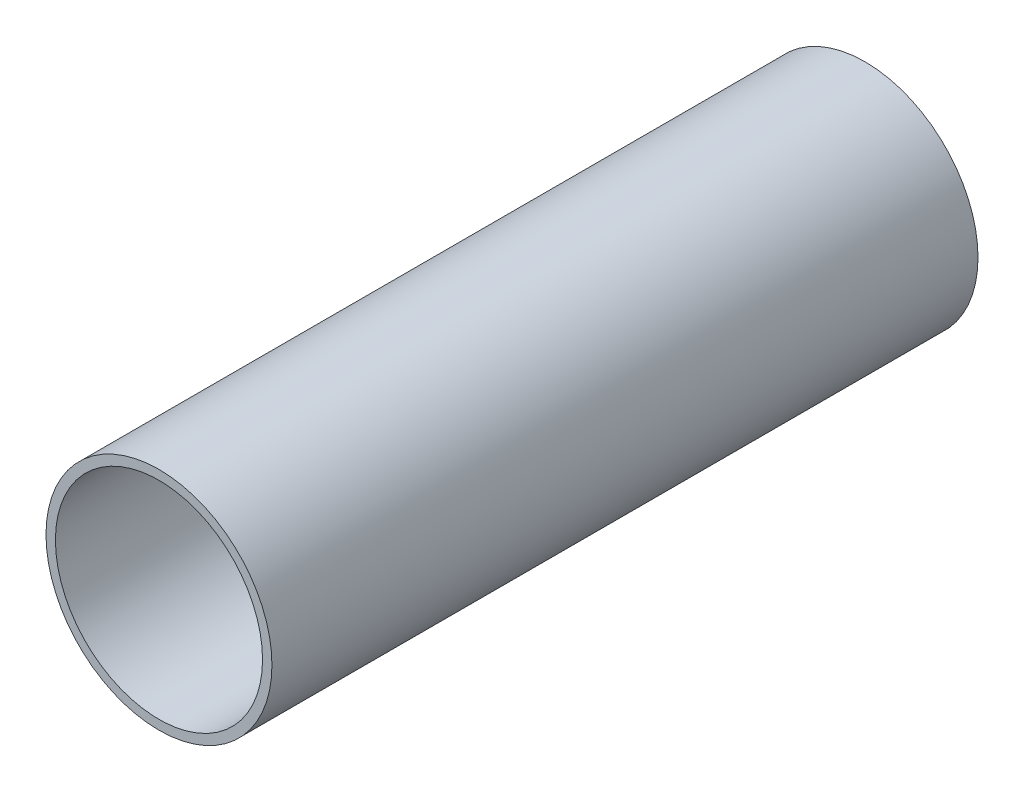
ISO-10303-21;
HEADER;
FILE_DESCRIPTION(('STEP AP214'),'2;1');
FILE_NAME('part.step','',(''),(''),'','','');
FILE_SCHEMA(('AUTOMOTIVE_DESIGN { 1 0 10303 214 1 1 1 1 }'));
ENDSEC;
DATA;
#1=APPLICATION_CONTEXT('core data for automotive mechanical design processes');
#2=APPLICATION_PROTOCOL_DEFINITION('international standard','automotive_design',2000,#1);
#3=PRODUCT_CONTEXT('',#1,'mechanical');
#4=PRODUCT('Part','Part','',(#3));
#5=PRODUCT_RELATED_PRODUCT_CATEGORY('part','',(#4));
#6=PRODUCT_DEFINITION_FORMATION('','',#4);
#7=PRODUCT_DEFINITION_CONTEXT('part definition',#1,'design');
#8=PRODUCT_DEFINITION('design','',#6,#7);
#9=PRODUCT_DEFINITION_SHAPE('','',#8);
#10=(LENGTH_UNIT() NAMED_UNIT(*) SI_UNIT(.MILLI.,.METRE.));
#11=(NAMED_UNIT(*) PLANE_ANGLE_UNIT() SI_UNIT($,.RADIAN.));
#12=(NAMED_UNIT(*) SI_UNIT($,.STERADIAN.) SOLID_ANGLE_UNIT());
#13=UNCERTAINTY_MEASURE_WITH_UNIT(LENGTH_MEASURE(1.E-05),#10,'distance_accuracy_value','');
#14=(GEOMETRIC_REPRESENTATION_CONTEXT(3) GLOBAL_UNCERTAINTY_ASSIGNED_CONTEXT((#13)) GLOBAL_UNIT_ASSIGNED_CONTEXT((#10,
#11,#12)) REPRESENTATION_CONTEXT('',''));
#15=CARTESIAN_POINT('',(0.,0.,0.));
#16=DIRECTION('',(0.,0.,1.));
#17=DIRECTION('',(1.,0.,0.));
#18=AXIS2_PLACEMENT_3D('',#15,#16,#17);
#19=CARTESIAN_POINT('',(0.,0.,150.));
#20=DIRECTION('',(0.,0.,1.));
#21=DIRECTION('',(1.,0.,0.));
#22=AXIS2_PLACEMENT_3D('',#19,#20,#21);
#23=PLANE('',#22);
#24=CARTESIAN_POINT('',(0.,0.,150.));
#25=DIRECTION('',(0.,0.,1.));
#26=DIRECTION('',(1.,0.,0.));
#27=AXIS2_PLACEMENT_3D('',#24,#25,#26);
#28=CIRCLE('',#27,24.);
#29=CARTESIAN_POINT('',(24.,0.,150.));
#30=VERTEX_POINT('',#29);
#31=EDGE_CURVE('E10',#30,#30,#28,.T.);
#32=ORIENTED_EDGE('',*,*,#31,.T.);
#33=EDGE_LOOP('',(#32));
#34=FACE_BOUND('',#33,.T.);
#35=CARTESIAN_POINT('',(0.,0.,150.));
#36=DIRECTION('',(0.,0.,1.));
#37=DIRECTION('',(1.,0.,0.));
#38=AXIS2_PLACEMENT_3D('',#35,#36,#37);
#39=CIRCLE('',#38,22.);
#40=CARTESIAN_POINT('',(22.,0.,150.));
#41=VERTEX_POINT('',#40);
#42=EDGE_CURVE('E37',#41,#41,#39,.T.);
#43=ORIENTED_EDGE('',*,*,#42,.F.);
#44=EDGE_LOOP('',(#43));
#45=FACE_BOUND('',#44,.T.);
#46=ADVANCED_FACE('F26',(#34,#45),#23,.T.);
#47=CARTESIAN_POINT('',(0.,0.,0.));
#48=DIRECTION('',(0.,0.,1.));
#49=DIRECTION('',(1.,0.,0.));
#50=AXIS2_PLACEMENT_3D('',#47,#48,#49);
#51=PLANE('',#50);
#52=CARTESIAN_POINT('',(0.,0.,0.));
#53=DIRECTION('',(0.,0.,1.));
#54=DIRECTION('',(1.,0.,0.));
#55=AXIS2_PLACEMENT_3D('',#52,#53,#54);
#56=CIRCLE('',#55,24.);
#57=CARTESIAN_POINT('',(24.,0.,0.));
#58=VERTEX_POINT('',#57);
#59=EDGE_CURVE('E33',#58,#58,#56,.T.);
#60=ORIENTED_EDGE('',*,*,#59,.F.);
#61=EDGE_LOOP('',(#60));
#62=FACE_BOUND('',#61,.T.);
#63=CARTESIAN_POINT('',(0.,0.,0.));
#64=DIRECTION('',(0.,0.,1.));
#65=DIRECTION('',(1.,0.,0.));
#66=AXIS2_PLACEMENT_3D('',#63,#64,#65);
#67=CIRCLE('',#66,22.);
#68=CARTESIAN_POINT('',(22.,0.,0.));
#69=VERTEX_POINT('',#68);
#70=EDGE_CURVE('E41',#69,#69,#67,.T.);
#71=ORIENTED_EDGE('',*,*,#70,.T.);
#72=EDGE_LOOP('',(#71));
#73=FACE_BOUND('',#72,.T.);
#74=ADVANCED_FACE('F47',(#62,#73),#51,.F.);
#75=CARTESIAN_POINT('',(0.,0.,150.));
#76=DIRECTION('',(0.,0.,-1.));
#77=DIRECTION('',(-1.,0.,0.));
#78=AXIS2_PLACEMENT_3D('',#75,#76,#77);
#79=CYLINDRICAL_SURFACE('',#78,24.);
#80=ORIENTED_EDGE('',*,*,#31,.F.);
#81=EDGE_LOOP('',(#80));
#82=FACE_BOUND('',#81,.T.);
#83=ORIENTED_EDGE('',*,*,#59,.T.);
#84=EDGE_LOOP('',(#83));
#85=FACE_BOUND('',#84,.T.);
#86=ADVANCED_FACE('F28',(#82,#85),#79,.T.);
#87=CARTESIAN_POINT('',(0.,0.,150.));
#88=DIRECTION('',(0.,0.,-1.));
#89=DIRECTION('',(-1.,0.,0.));
#90=AXIS2_PLACEMENT_3D('',#87,#88,#89);
#91=CYLINDRICAL_SURFACE('',#90,22.);
#92=ORIENTED_EDGE('',*,*,#42,.T.);
#93=EDGE_LOOP('',(#92));
#94=FACE_BOUND('',#93,.T.);
#95=ORIENTED_EDGE('',*,*,#70,.F.);
#96=EDGE_LOOP('',(#95));
#97=FACE_BOUND('',#96,.T.);
#98=ADVANCED_FACE('F49',(#94,#97),#91,.F.);
#99=CLOSED_SHELL('',(#46,#74,#86,#98));
#100=MANIFOLD_SOLID_BREP('B2',#99);
#101=ADVANCED_BREP_SHAPE_REPRESENTATION('',(#18,#100),#14);
#102=SHAPE_DEFINITION_REPRESENTATION(#9,#101);
ENDSEC;
END-ISO-10303-21;
